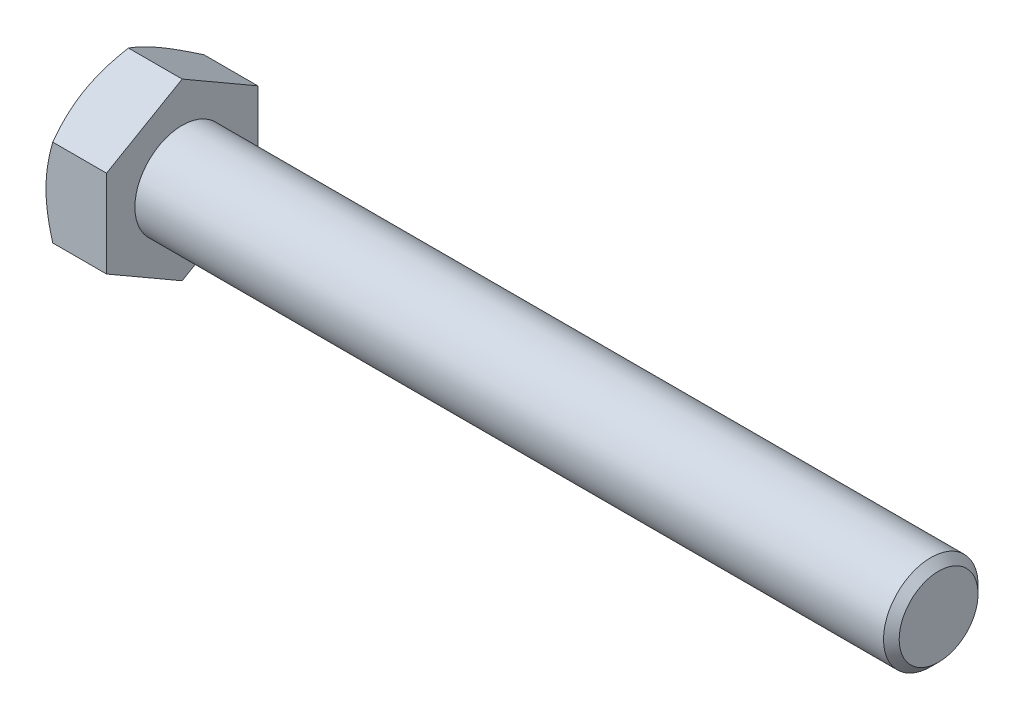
from build123d import *

# Parameters (mm, degrees)
BASEHEAD_DEPTH = 6.4


with BuildPart() as part:
    # BaseHeadSke → BaseHead (new body)
    with BuildSketch(Plane(origin=(0, 0, 0), x_dir=(0, 0, -1), z_dir=(1, 0, 0))):
        Polygon((0, 9.237604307), (-8, 4.618802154), (-8, -4.618802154), (0, -9.237604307), (8, -4.618802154), (8, 4.618802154), align=None)
    extrude(amount=BASEHEAD_DEPTH)

    # HeadChamferSke → HeadChamfer (revolve, cut)
    with BuildSketch(Plane.XY):
        Polygon((0, 9.237604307), (0, 8), (0.71453118, 9.237604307), align=None)
    revolve(axis=Axis((0, 0, 0), (1, 0, 0)), mode=Mode.SUBTRACT)

    # BodySke → BaseBody (revolve)
    with BuildSketch(Plane.XY, mode=Mode.PRIVATE) as basebody_sk:
        Polygon((0, 0), (0, 5), (85.572, 5), (86.4, 4.172), (86.4, 0), align=None)
    revolve(basebody_sk.sketch.rotate(Axis((0, 0, 0), (1, 0, 0)), 90), axis=Axis((0, 0, 0), (1, 0, 0)))


solid = part.part
